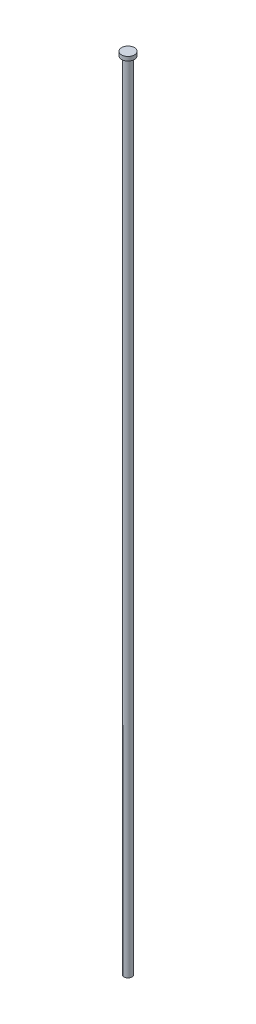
from build123d import *

# Parameters (mm, degrees)
PINDIA_R            = 5
LENGTH_DEPTH        = 1000
HEADDIA_R           = 8
HEADTHICKNESS_DEPTH = 5
FILLET1_R           = 0.5


with BuildPart() as part:
    # PinDia → Length (new body)
    with BuildSketch(Plane(origin=(0, 0, 0), x_dir=(1, 0, 0), z_dir=(0, 1, 0))):
        with Locations(Location((0, 0, 0), (0, 0, 270))):
            Circle(PINDIA_R)
    extrude(amount=-LENGTH_DEPTH)

    # HeadDia → HeadThickness (add)
    with BuildSketch(Plane(origin=(0, 0, 0), x_dir=(1, 0, 0), z_dir=(0, 1, 0))):
        with Locations(Location((0, 0, 0), (0, 0, 270))):
            Circle(HEADDIA_R)
    extrude(amount=-HEADTHICKNESS_DEPTH)

    # Fillet1
    fillet1_edges = [part.edges().sort_by_distance(p)[0] for p in [
        (0, -5, -5),
    ]]
    fillet(fillet1_edges, radius=FILLET1_R)


solid = part.part
